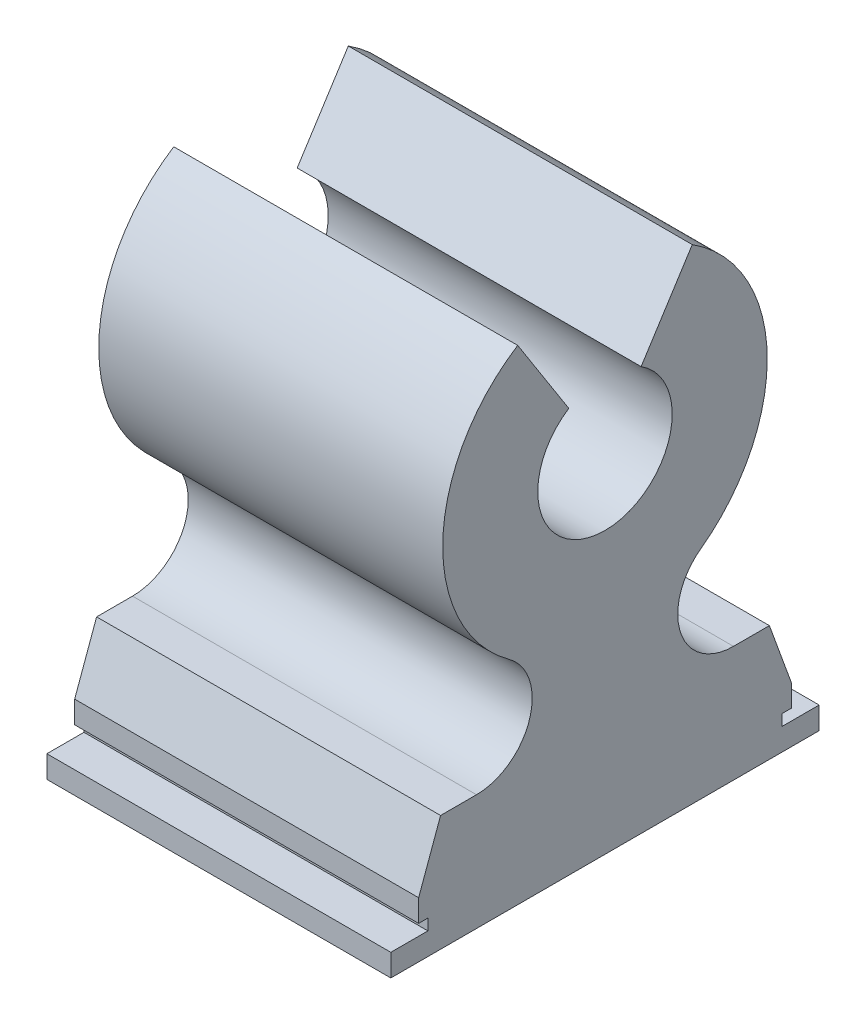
ISO-10303-21;
HEADER;
FILE_DESCRIPTION(('STEP AP214'),'2;1');
FILE_NAME('part.step','',(''),(''),'','','');
FILE_SCHEMA(('AUTOMOTIVE_DESIGN { 1 0 10303 214 1 1 1 1 }'));
ENDSEC;
DATA;
#1=APPLICATION_CONTEXT('core data for automotive mechanical design processes');
#2=APPLICATION_PROTOCOL_DEFINITION('international standard','automotive_design',2000,#1);
#3=PRODUCT_CONTEXT('',#1,'mechanical');
#4=PRODUCT('Part','Part','',(#3));
#5=PRODUCT_RELATED_PRODUCT_CATEGORY('part','',(#4));
#6=PRODUCT_DEFINITION_FORMATION('','',#4);
#7=PRODUCT_DEFINITION_CONTEXT('part definition',#1,'design');
#8=PRODUCT_DEFINITION('design','',#6,#7);
#9=PRODUCT_DEFINITION_SHAPE('','',#8);
#10=(LENGTH_UNIT() NAMED_UNIT(*) SI_UNIT(.MILLI.,.METRE.));
#11=(NAMED_UNIT(*) PLANE_ANGLE_UNIT() SI_UNIT($,.RADIAN.));
#12=(NAMED_UNIT(*) SI_UNIT($,.STERADIAN.) SOLID_ANGLE_UNIT());
#13=UNCERTAINTY_MEASURE_WITH_UNIT(LENGTH_MEASURE(1.E-05),#10,'distance_accuracy_value','');
#14=(GEOMETRIC_REPRESENTATION_CONTEXT(3) GLOBAL_UNCERTAINTY_ASSIGNED_CONTEXT((#13)) GLOBAL_UNIT_ASSIGNED_CONTEXT((#10,
#11,#12)) REPRESENTATION_CONTEXT('',''));
#15=CARTESIAN_POINT('',(0.,0.,0.));
#16=DIRECTION('',(0.,0.,1.));
#17=DIRECTION('',(1.,0.,0.));
#18=AXIS2_PLACEMENT_3D('',#15,#16,#17);
#19=CARTESIAN_POINT('',(9.4234,-9.525,5.8674));
#20=DIRECTION('',(0.,0.,-1.));
#21=DIRECTION('',(0.,1.,0.));
#22=AXIS2_PLACEMENT_3D('',#19,#20,#21);
#23=PLANE('',#22);
#24=DIRECTION('',(0.,-1.,0.));
#25=VECTOR('',#24,1.);
#26=CARTESIAN_POINT('',(0.,-9.525,5.8674));
#27=LINE('',#26,#25);
#28=CARTESIAN_POINT('',(0.,-8.9154,5.8674));
#29=VERTEX_POINT('',#28);
#30=CARTESIAN_POINT('',(0.,-9.525,5.8674));
#31=VERTEX_POINT('',#30);
#32=EDGE_CURVE('E213',#29,#31,#27,.T.);
#33=ORIENTED_EDGE('',*,*,#32,.T.);
#34=DIRECTION('',(-1.,0.,0.));
#35=VECTOR('',#34,1.);
#36=CARTESIAN_POINT('',(9.4234,-9.525,5.8674));
#37=LINE('',#36,#35);
#38=CARTESIAN_POINT('',(9.4234,-9.525,5.8674));
#39=VERTEX_POINT('',#38);
#40=EDGE_CURVE('E11',#39,#31,#37,.T.);
#41=ORIENTED_EDGE('',*,*,#40,.F.);
#42=DIRECTION('',(0.,-1.,0.));
#43=VECTOR('',#42,1.);
#44=CARTESIAN_POINT('',(9.4234,-9.525,5.8674));
#45=LINE('',#44,#43);
#46=CARTESIAN_POINT('',(9.4234,-8.9154,5.8674));
#47=VERTEX_POINT('',#46);
#48=EDGE_CURVE('E255',#47,#39,#45,.T.);
#49=ORIENTED_EDGE('',*,*,#48,.F.);
#50=DIRECTION('',(-1.,0.,0.));
#51=VECTOR('',#50,1.);
#52=CARTESIAN_POINT('',(9.4234,-8.9154,5.8674));
#53=LINE('',#52,#51);
#54=EDGE_CURVE('E209',#47,#29,#53,.T.);
#55=ORIENTED_EDGE('',*,*,#54,.T.);
#56=EDGE_LOOP('',(#33,#41,#49,#55));
#57=FACE_BOUND('',#56,.T.);
#58=ADVANCED_FACE('F33',(#57),#23,.F.);
#59=CARTESIAN_POINT('',(9.4234,-9.525,5.8674));
#60=DIRECTION('',(0.,1.,0.));
#61=DIRECTION('',(0.,0.,1.));
#62=AXIS2_PLACEMENT_3D('',#59,#60,#61);
#63=PLANE('',#62);
#64=DIRECTION('',(0.,0.,-1.));
#65=VECTOR('',#64,1.);
#66=CARTESIAN_POINT('',(0.,-9.525,5.8674));
#67=LINE('',#66,#65);
#68=CARTESIAN_POINT('',(0.,-9.525,-5.8674));
#69=VERTEX_POINT('',#68);
#70=EDGE_CURVE('E216',#31,#69,#67,.T.);
#71=ORIENTED_EDGE('',*,*,#70,.T.);
#72=DIRECTION('',(-1.,0.,0.));
#73=VECTOR('',#72,1.);
#74=CARTESIAN_POINT('',(9.4234,-9.525,-5.8674));
#75=LINE('',#74,#73);
#76=CARTESIAN_POINT('',(9.4234,-9.525,-5.8674));
#77=VERTEX_POINT('',#76);
#78=EDGE_CURVE('E41',#77,#69,#75,.T.);
#79=ORIENTED_EDGE('',*,*,#78,.F.);
#80=DIRECTION('',(0.,0.,-1.));
#81=VECTOR('',#80,1.);
#82=CARTESIAN_POINT('',(9.4234,-9.525,5.8674));
#83=LINE('',#82,#81);
#84=EDGE_CURVE('E134',#39,#77,#83,.T.);
#85=ORIENTED_EDGE('',*,*,#84,.F.);
#86=ORIENTED_EDGE('',*,*,#40,.T.);
#87=EDGE_LOOP('',(#71,#79,#85,#86));
#88=FACE_BOUND('',#87,.T.);
#89=ADVANCED_FACE('F383',(#88),#63,.F.);
#90=CARTESIAN_POINT('',(9.4234,-9.525,-5.8674));
#91=DIRECTION('',(0.,0.,1.));
#92=DIRECTION('',(0.,-1.,0.));
#93=AXIS2_PLACEMENT_3D('',#90,#91,#92);
#94=PLANE('',#93);
#95=DIRECTION('',(0.,1.,0.));
#96=VECTOR('',#95,1.);
#97=CARTESIAN_POINT('',(0.,-9.525,-5.8674));
#98=LINE('',#97,#96);
#99=CARTESIAN_POINT('',(0.,-8.9154,-5.8674));
#100=VERTEX_POINT('',#99);
#101=EDGE_CURVE('E218',#69,#100,#98,.T.);
#102=ORIENTED_EDGE('',*,*,#101,.T.);
#103=DIRECTION('',(-1.,0.,0.));
#104=VECTOR('',#103,1.);
#105=CARTESIAN_POINT('',(9.4234,-8.9154,-5.8674));
#106=LINE('',#105,#104);
#107=CARTESIAN_POINT('',(9.4234,-8.9154,-5.8674));
#108=VERTEX_POINT('',#107);
#109=EDGE_CURVE('E304',#108,#100,#106,.T.);
#110=ORIENTED_EDGE('',*,*,#109,.F.);
#111=DIRECTION('',(0.,1.,0.));
#112=VECTOR('',#111,1.);
#113=CARTESIAN_POINT('',(9.4234,-9.525,-5.8674));
#114=LINE('',#113,#112);
#115=EDGE_CURVE('E312',#77,#108,#114,.T.);
#116=ORIENTED_EDGE('',*,*,#115,.F.);
#117=ORIENTED_EDGE('',*,*,#78,.T.);
#118=EDGE_LOOP('',(#102,#110,#116,#117));
#119=FACE_BOUND('',#118,.T.);
#120=ADVANCED_FACE('F310',(#119),#94,.F.);
#121=CARTESIAN_POINT('',(9.4234,-8.9154,-5.8674));
#122=DIRECTION('',(0.,-1.,0.));
#123=DIRECTION('',(0.,0.,-1.));
#124=AXIS2_PLACEMENT_3D('',#121,#122,#123);
#125=PLANE('',#124);
#126=DIRECTION('',(0.,0.,1.));
#127=VECTOR('',#126,1.);
#128=CARTESIAN_POINT('',(0.,-8.9154,-5.8674));
#129=LINE('',#128,#127);
#130=CARTESIAN_POINT('',(0.,-8.9154,-4.8514));
#131=VERTEX_POINT('',#130);
#132=EDGE_CURVE('E220',#100,#131,#129,.T.);
#133=ORIENTED_EDGE('',*,*,#132,.T.);
#134=DIRECTION('',(-1.,0.,0.));
#135=VECTOR('',#134,1.);
#136=CARTESIAN_POINT('',(9.4234,-8.9154,-4.8514));
#137=LINE('',#136,#135);
#138=CARTESIAN_POINT('',(9.4234,-8.9154,-4.8514));
#139=VERTEX_POINT('',#138);
#140=EDGE_CURVE('E301',#139,#131,#137,.T.);
#141=ORIENTED_EDGE('',*,*,#140,.F.);
#142=DIRECTION('',(0.,0.,1.));
#143=VECTOR('',#142,1.);
#144=CARTESIAN_POINT('',(9.4234,-8.9154,-5.8674));
#145=LINE('',#144,#143);
#146=EDGE_CURVE('E330',#108,#139,#145,.T.);
#147=ORIENTED_EDGE('',*,*,#146,.F.);
#148=ORIENTED_EDGE('',*,*,#109,.T.);
#149=EDGE_LOOP('',(#133,#141,#147,#148));
#150=FACE_BOUND('',#149,.T.);
#151=ADVANCED_FACE('F321',(#150),#125,.F.);
#152=CARTESIAN_POINT('',(9.4234,-8.9154,-4.8514));
#153=DIRECTION('',(0.,0.,1.));
#154=DIRECTION('',(0.,-1.,0.));
#155=AXIS2_PLACEMENT_3D('',#152,#153,#154);
#156=PLANE('',#155);
#157=DIRECTION('',(0.,1.,0.));
#158=VECTOR('',#157,1.);
#159=CARTESIAN_POINT('',(0.,-8.9154,-4.8514));
#160=LINE('',#159,#158);
#161=CARTESIAN_POINT('',(0.,-8.6106,-4.8514));
#162=VERTEX_POINT('',#161);
#163=EDGE_CURVE('E222',#131,#162,#160,.T.);
#164=ORIENTED_EDGE('',*,*,#163,.T.);
#165=DIRECTION('',(-1.,0.,0.));
#166=VECTOR('',#165,1.);
#167=CARTESIAN_POINT('',(9.4234,-8.6106,-4.8514));
#168=LINE('',#167,#166);
#169=CARTESIAN_POINT('',(9.4234,-8.6106,-4.8514));
#170=VERTEX_POINT('',#169);
#171=EDGE_CURVE('E298',#170,#162,#168,.T.);
#172=ORIENTED_EDGE('',*,*,#171,.F.);
#173=DIRECTION('',(0.,1.,0.));
#174=VECTOR('',#173,1.);
#175=CARTESIAN_POINT('',(9.4234,-8.9154,-4.8514));
#176=LINE('',#175,#174);
#177=EDGE_CURVE('E327',#139,#170,#176,.T.);
#178=ORIENTED_EDGE('',*,*,#177,.F.);
#179=ORIENTED_EDGE('',*,*,#140,.T.);
#180=EDGE_LOOP('',(#164,#172,#178,#179));
#181=FACE_BOUND('',#180,.T.);
#182=ADVANCED_FACE('F325',(#181),#156,.F.);
#183=CARTESIAN_POINT('',(9.4234,-8.6106,-4.8514));
#184=DIRECTION('',(0.,1.,0.));
#185=DIRECTION('',(0.,0.,1.));
#186=AXIS2_PLACEMENT_3D('',#183,#184,#185);
#187=PLANE('',#186);
#188=DIRECTION('',(0.,0.,-1.));
#189=VECTOR('',#188,1.);
#190=CARTESIAN_POINT('',(0.,-8.6106,-4.8514));
#191=LINE('',#190,#189);
#192=CARTESIAN_POINT('',(0.,-8.6106,-5.1054));
#193=VERTEX_POINT('',#192);
#194=EDGE_CURVE('E224',#162,#193,#191,.T.);
#195=ORIENTED_EDGE('',*,*,#194,.T.);
#196=DIRECTION('',(-1.,0.,0.));
#197=VECTOR('',#196,1.);
#198=CARTESIAN_POINT('',(9.4234,-8.6106,-5.1054));
#199=LINE('',#198,#197);
#200=CARTESIAN_POINT('',(9.4234,-8.6106,-5.1054));
#201=VERTEX_POINT('',#200);
#202=EDGE_CURVE('E295',#201,#193,#199,.T.);
#203=ORIENTED_EDGE('',*,*,#202,.F.);
#204=DIRECTION('',(0.,0.,-1.));
#205=VECTOR('',#204,1.);
#206=CARTESIAN_POINT('',(9.4234,-8.6106,-4.8514));
#207=LINE('',#206,#205);
#208=EDGE_CURVE('E329',#170,#201,#207,.T.);
#209=ORIENTED_EDGE('',*,*,#208,.F.);
#210=ORIENTED_EDGE('',*,*,#171,.T.);
#211=EDGE_LOOP('',(#195,#203,#209,#210));
#212=FACE_BOUND('',#211,.T.);
#213=ADVANCED_FACE('F396',(#212),#187,.F.);
#214=CARTESIAN_POINT('',(9.4234,-8.001,-5.1054));
#215=DIRECTION('',(0.,0.,1.));
#216=DIRECTION('',(0.,-1.,0.));
#217=AXIS2_PLACEMENT_3D('',#214,#215,#216);
#218=PLANE('',#217);
#219=DIRECTION('',(0.,1.,0.));
#220=VECTOR('',#219,1.);
#221=CARTESIAN_POINT('',(0.,-8.001,-5.1054));
#222=LINE('',#221,#220);
#223=CARTESIAN_POINT('',(0.,-8.001,-5.1054));
#224=VERTEX_POINT('',#223);
#225=EDGE_CURVE('E226',#193,#224,#222,.T.);
#226=ORIENTED_EDGE('',*,*,#225,.T.);
#227=DIRECTION('',(-1.,0.,0.));
#228=VECTOR('',#227,1.);
#229=CARTESIAN_POINT('',(9.4234,-8.001,-5.1054));
#230=LINE('',#229,#228);
#231=CARTESIAN_POINT('',(9.4234,-8.001,-5.1054));
#232=VERTEX_POINT('',#231);
#233=EDGE_CURVE('E292',#232,#224,#230,.T.);
#234=ORIENTED_EDGE('',*,*,#233,.F.);
#235=DIRECTION('',(0.,1.,0.));
#236=VECTOR('',#235,1.);
#237=CARTESIAN_POINT('',(9.4234,-8.001,-5.1054));
#238=LINE('',#237,#236);
#239=EDGE_CURVE('E332',#201,#232,#238,.T.);
#240=ORIENTED_EDGE('',*,*,#239,.F.);
#241=ORIENTED_EDGE('',*,*,#202,.T.);
#242=EDGE_LOOP('',(#226,#234,#240,#241));
#243=FACE_BOUND('',#242,.T.);
#244=ADVANCED_FACE('F399',(#243),#218,.F.);
#245=CARTESIAN_POINT('',(9.4234,-6.35,-4.5044851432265));
#246=DIRECTION('',(0.,-0.34202014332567,0.939692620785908));
#247=DIRECTION('',(0.,-0.939692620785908,-0.34202014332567));
#248=AXIS2_PLACEMENT_3D('',#245,#246,#247);
#249=PLANE('',#248);
#250=DIRECTION('',(0.,0.939692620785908,0.34202014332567));
#251=VECTOR('',#250,1.);
#252=CARTESIAN_POINT('',(0.,-6.35,-4.5044851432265));
#253=LINE('',#252,#251);
#254=CARTESIAN_POINT('',(0.,-6.35,-4.5044851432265));
#255=VERTEX_POINT('',#254);
#256=EDGE_CURVE('E228',#224,#255,#253,.T.);
#257=ORIENTED_EDGE('',*,*,#256,.T.);
#258=DIRECTION('',(-1.,0.,0.));
#259=VECTOR('',#258,1.);
#260=CARTESIAN_POINT('',(9.4234,-6.35,-4.5044851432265));
#261=LINE('',#260,#259);
#262=CARTESIAN_POINT('',(9.4234,-6.35,-4.5044851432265));
#263=VERTEX_POINT('',#262);
#264=EDGE_CURVE('E289',#263,#255,#261,.T.);
#265=ORIENTED_EDGE('',*,*,#264,.F.);
#266=DIRECTION('',(0.,0.939692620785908,0.34202014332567));
#267=VECTOR('',#266,1.);
#268=CARTESIAN_POINT('',(9.4234,-6.35,-4.5044851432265));
#269=LINE('',#268,#267);
#270=EDGE_CURVE('E338',#232,#263,#269,.T.);
#271=ORIENTED_EDGE('',*,*,#270,.F.);
#272=ORIENTED_EDGE('',*,*,#233,.T.);
#273=EDGE_LOOP('',(#257,#265,#271,#272));
#274=FACE_BOUND('',#273,.T.);
#275=ADVANCED_FACE('F403',(#274),#249,.F.);
#276=CARTESIAN_POINT('',(9.4234,-6.35,-4.5044851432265));
#277=DIRECTION('',(0.,-1.,0.));
#278=DIRECTION('',(0.,0.,-1.));
#279=AXIS2_PLACEMENT_3D('',#276,#277,#278);
#280=PLANE('',#279);
#281=DIRECTION('',(0.,0.,1.));
#282=VECTOR('',#281,1.);
#283=CARTESIAN_POINT('',(0.,-6.35,-4.5044851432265));
#284=LINE('',#283,#282);
#285=CARTESIAN_POINT('',(0.,-6.35,-3.5204382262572));
#286=VERTEX_POINT('',#285);
#287=EDGE_CURVE('E230',#255,#286,#284,.T.);
#288=ORIENTED_EDGE('',*,*,#287,.T.);
#289=DIRECTION('',(-1.,0.,0.));
#290=VECTOR('',#289,1.);
#291=CARTESIAN_POINT('',(9.4234,-6.35,-3.5204382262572));
#292=LINE('',#291,#290);
#293=CARTESIAN_POINT('',(9.4234,-6.35,-3.5204382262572));
#294=VERTEX_POINT('',#293);
#295=EDGE_CURVE('E286',#294,#286,#292,.T.);
#296=ORIENTED_EDGE('',*,*,#295,.F.);
#297=DIRECTION('',(0.,0.,1.));
#298=VECTOR('',#297,1.);
#299=CARTESIAN_POINT('',(9.4234,-6.35,-4.5044851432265));
#300=LINE('',#299,#298);
#301=EDGE_CURVE('E340',#263,#294,#300,.T.);
#302=ORIENTED_EDGE('',*,*,#301,.F.);
#303=ORIENTED_EDGE('',*,*,#264,.T.);
#304=EDGE_LOOP('',(#288,#296,#302,#303));
#305=FACE_BOUND('',#304,.T.);
#306=ADVANCED_FACE('F407',(#305),#280,.F.);
#307=CARTESIAN_POINT('',(9.4234,-4.8234617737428,-3.5204382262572));
#308=DIRECTION('',(-1.,0.,0.));
#309=DIRECTION('',(0.,0.,1.));
#310=AXIS2_PLACEMENT_3D('',#307,#308,#309);
#311=CYLINDRICAL_SURFACE('',#310,1.5265382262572);
#312=CARTESIAN_POINT('',(0.,-4.8234617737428,-3.5204382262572));
#313=DIRECTION('',(-1.,0.,0.));
#314=DIRECTION('',(0.,0.,1.));
#315=AXIS2_PLACEMENT_3D('',#312,#313,#314);
#316=CIRCLE('',#315,1.5265382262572);
#317=CARTESIAN_POINT('',(0.,-3.59041285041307,-2.62048861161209));
#318=VERTEX_POINT('',#317);
#319=EDGE_CURVE('E232',#286,#318,#316,.T.);
#320=ORIENTED_EDGE('',*,*,#319,.T.);
#321=DIRECTION('',(-1.,0.,0.));
#322=VECTOR('',#321,1.);
#323=CARTESIAN_POINT('',(9.4234,-3.59041285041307,-2.62048861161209));
#324=LINE('',#323,#322);
#325=CARTESIAN_POINT('',(9.4234,-3.59041285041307,-2.62048861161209));
#326=VERTEX_POINT('',#325);
#327=EDGE_CURVE('E283',#326,#318,#324,.T.);
#328=ORIENTED_EDGE('',*,*,#327,.F.);
#329=CARTESIAN_POINT('',(9.4234,-4.8234617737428,-3.5204382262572));
#330=DIRECTION('',(-1.,0.,0.));
#331=DIRECTION('',(0.,0.,1.));
#332=AXIS2_PLACEMENT_3D('',#329,#330,#331);
#333=CIRCLE('',#332,1.5265382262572);
#334=EDGE_CURVE('E342',#294,#326,#333,.T.);
#335=ORIENTED_EDGE('',*,*,#334,.F.);
#336=ORIENTED_EDGE('',*,*,#295,.T.);
#337=EDGE_LOOP('',(#320,#328,#335,#336));
#338=FACE_BOUND('',#337,.T.);
#339=ADVANCED_FACE('F411',(#338),#311,.F.);
#340=CARTESIAN_POINT('',(9.4234,0.,0.));
#341=DIRECTION('',(-1.,0.,0.));
#342=DIRECTION('',(0.,0.,1.));
#343=AXIS2_PLACEMENT_3D('',#340,#341,#342);
#344=CYLINDRICAL_SURFACE('',#343,4.445);
#345=CARTESIAN_POINT('',(0.,0.,0.));
#346=DIRECTION('',(1.,0.,0.));
#347=DIRECTION('',(0.,0.,-1.));
#348=AXIS2_PLACEMENT_3D('',#345,#346,#347);
#349=CIRCLE('',#348,4.445);
#350=CARTESIAN_POINT('',(0.,3.74708544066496,-2.39110344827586));
#351=VERTEX_POINT('',#350);
#352=EDGE_CURVE('E234',#318,#351,#349,.T.);
#353=ORIENTED_EDGE('',*,*,#352,.T.);
#354=DIRECTION('',(-1.,0.,0.));
#355=VECTOR('',#354,1.);
#356=CARTESIAN_POINT('',(9.4234,3.74708544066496,-2.39110344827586));
#357=LINE('',#356,#355);
#358=CARTESIAN_POINT('',(9.4234,3.74708544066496,-2.39110344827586));
#359=VERTEX_POINT('',#358);
#360=EDGE_CURVE('E280',#359,#351,#357,.T.);
#361=ORIENTED_EDGE('',*,*,#360,.F.);
#362=CARTESIAN_POINT('',(9.4234,0.,0.));
#363=DIRECTION('',(1.,0.,0.));
#364=DIRECTION('',(0.,0.,-1.));
#365=AXIS2_PLACEMENT_3D('',#362,#363,#364);
#366=CIRCLE('',#365,4.445);
#367=EDGE_CURVE('E344',#326,#359,#366,.T.);
#368=ORIENTED_EDGE('',*,*,#367,.F.);
#369=ORIENTED_EDGE('',*,*,#327,.T.);
#370=EDGE_LOOP('',(#353,#361,#368,#369));
#371=FACE_BOUND('',#370,.T.);
#372=ADVANCED_FACE('F415',(#371),#344,.T.);
#373=CARTESIAN_POINT('',(9.4234,1.55236396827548,-0.9906));
#374=DIRECTION('',(0.,-0.537931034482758,-0.842988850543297));
#375=DIRECTION('',(0.,0.842988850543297,-0.537931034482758));
#376=AXIS2_PLACEMENT_3D('',#373,#374,#375);
#377=PLANE('',#376);
#378=DIRECTION('',(0.,-0.842988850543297,0.537931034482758));
#379=VECTOR('',#378,1.);
#380=CARTESIAN_POINT('',(0.,1.55236396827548,-0.9906));
#381=LINE('',#380,#379);
#382=CARTESIAN_POINT('',(0.,1.55236396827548,-0.9906));
#383=VERTEX_POINT('',#382);
#384=EDGE_CURVE('E236',#351,#383,#381,.T.);
#385=ORIENTED_EDGE('',*,*,#384,.T.);
#386=DIRECTION('',(-1.,0.,0.));
#387=VECTOR('',#386,1.);
#388=CARTESIAN_POINT('',(9.4234,1.55236396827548,-0.9906));
#389=LINE('',#388,#387);
#390=CARTESIAN_POINT('',(9.4234,1.55236396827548,-0.9906));
#391=VERTEX_POINT('',#390);
#392=EDGE_CURVE('E277',#391,#383,#389,.T.);
#393=ORIENTED_EDGE('',*,*,#392,.F.);
#394=DIRECTION('',(0.,-0.842988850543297,0.537931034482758));
#395=VECTOR('',#394,1.);
#396=CARTESIAN_POINT('',(9.4234,1.55236396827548,-0.9906));
#397=LINE('',#396,#395);
#398=EDGE_CURVE('E346',#359,#391,#397,.T.);
#399=ORIENTED_EDGE('',*,*,#398,.F.);
#400=ORIENTED_EDGE('',*,*,#360,.T.);
#401=EDGE_LOOP('',(#385,#393,#399,#400));
#402=FACE_BOUND('',#401,.T.);
#403=ADVANCED_FACE('F419',(#402),#377,.F.);
#404=CARTESIAN_POINT('',(9.4234,0.,0.));
#405=DIRECTION('',(-1.,0.,0.));
#406=DIRECTION('',(0.,0.,1.));
#407=AXIS2_PLACEMENT_3D('',#404,#405,#406);
#408=CYLINDRICAL_SURFACE('',#407,1.8415);
#409=CARTESIAN_POINT('',(0.,0.,0.));
#410=DIRECTION('',(-1.,0.,0.));
#411=DIRECTION('',(0.,0.,-1.));
#412=AXIS2_PLACEMENT_3D('',#409,#410,#411);
#413=CIRCLE('',#412,1.8415);
#414=CARTESIAN_POINT('',(0.,1.55236396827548,0.990599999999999));
#415=VERTEX_POINT('',#414);
#416=EDGE_CURVE('E238',#383,#415,#413,.T.);
#417=ORIENTED_EDGE('',*,*,#416,.T.);
#418=DIRECTION('',(-1.,0.,0.));
#419=VECTOR('',#418,1.);
#420=CARTESIAN_POINT('',(9.4234,1.55236396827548,0.990599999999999));
#421=LINE('',#420,#419);
#422=CARTESIAN_POINT('',(9.4234,1.55236396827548,0.990599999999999));
#423=VERTEX_POINT('',#422);
#424=EDGE_CURVE('E274',#423,#415,#421,.T.);
#425=ORIENTED_EDGE('',*,*,#424,.F.);
#426=CARTESIAN_POINT('',(9.4234,0.,0.));
#427=DIRECTION('',(-1.,0.,0.));
#428=DIRECTION('',(0.,0.,-1.));
#429=AXIS2_PLACEMENT_3D('',#426,#427,#428);
#430=CIRCLE('',#429,1.8415);
#431=EDGE_CURVE('E348',#391,#423,#430,.T.);
#432=ORIENTED_EDGE('',*,*,#431,.F.);
#433=ORIENTED_EDGE('',*,*,#392,.T.);
#434=EDGE_LOOP('',(#417,#425,#432,#433));
#435=FACE_BOUND('',#434,.T.);
#436=ADVANCED_FACE('F423',(#435),#408,.F.);
#437=CARTESIAN_POINT('',(9.4234,1.55236396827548,0.9906));
#438=DIRECTION('',(0.,-0.537931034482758,0.842988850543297));
#439=DIRECTION('',(0.,-0.842988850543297,-0.537931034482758));
#440=AXIS2_PLACEMENT_3D('',#437,#438,#439);
#441=PLANE('',#440);
#442=DIRECTION('',(0.,0.842988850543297,0.537931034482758));
#443=VECTOR('',#442,1.);
#444=CARTESIAN_POINT('',(0.,1.55236396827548,0.9906));
#445=LINE('',#444,#443);
#446=CARTESIAN_POINT('',(0.,3.74708544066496,2.39110344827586));
#447=VERTEX_POINT('',#446);
#448=EDGE_CURVE('E240',#415,#447,#445,.T.);
#449=ORIENTED_EDGE('',*,*,#448,.T.);
#450=DIRECTION('',(-1.,0.,0.));
#451=VECTOR('',#450,1.);
#452=CARTESIAN_POINT('',(9.4234,3.74708544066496,2.39110344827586));
#453=LINE('',#452,#451);
#454=CARTESIAN_POINT('',(9.4234,3.74708544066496,2.39110344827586));
#455=VERTEX_POINT('',#454);
#456=EDGE_CURVE('E271',#455,#447,#453,.T.);
#457=ORIENTED_EDGE('',*,*,#456,.F.);
#458=DIRECTION('',(0.,0.842988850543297,0.537931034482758));
#459=VECTOR('',#458,1.);
#460=CARTESIAN_POINT('',(9.4234,1.55236396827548,0.9906));
#461=LINE('',#460,#459);
#462=EDGE_CURVE('E350',#423,#455,#461,.T.);
#463=ORIENTED_EDGE('',*,*,#462,.F.);
#464=ORIENTED_EDGE('',*,*,#424,.T.);
#465=EDGE_LOOP('',(#449,#457,#463,#464));
#466=FACE_BOUND('',#465,.T.);
#467=ADVANCED_FACE('F427',(#466),#441,.F.);
#468=CARTESIAN_POINT('',(9.4234,0.,0.));
#469=DIRECTION('',(-1.,0.,0.));
#470=DIRECTION('',(0.,0.,1.));
#471=AXIS2_PLACEMENT_3D('',#468,#469,#470);
#472=CYLINDRICAL_SURFACE('',#471,4.445);
#473=CARTESIAN_POINT('',(0.,0.,0.));
#474=DIRECTION('',(1.,0.,0.));
#475=DIRECTION('',(0.,0.,-1.));
#476=AXIS2_PLACEMENT_3D('',#473,#474,#475);
#477=CIRCLE('',#476,4.445);
#478=CARTESIAN_POINT('',(0.,-3.59041285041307,2.62048861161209));
#479=VERTEX_POINT('',#478);
#480=EDGE_CURVE('E242',#447,#479,#477,.T.);
#481=ORIENTED_EDGE('',*,*,#480,.T.);
#482=DIRECTION('',(-1.,0.,0.));
#483=VECTOR('',#482,1.);
#484=CARTESIAN_POINT('',(9.4234,-3.59041285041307,2.62048861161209));
#485=LINE('',#484,#483);
#486=CARTESIAN_POINT('',(9.4234,-3.59041285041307,2.62048861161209));
#487=VERTEX_POINT('',#486);
#488=EDGE_CURVE('E268',#487,#479,#485,.T.);
#489=ORIENTED_EDGE('',*,*,#488,.F.);
#490=CARTESIAN_POINT('',(9.4234,0.,0.));
#491=DIRECTION('',(1.,0.,0.));
#492=DIRECTION('',(0.,0.,-1.));
#493=AXIS2_PLACEMENT_3D('',#490,#491,#492);
#494=CIRCLE('',#493,4.445);
#495=EDGE_CURVE('E352',#455,#487,#494,.T.);
#496=ORIENTED_EDGE('',*,*,#495,.F.);
#497=ORIENTED_EDGE('',*,*,#456,.T.);
#498=EDGE_LOOP('',(#481,#489,#496,#497));
#499=FACE_BOUND('',#498,.T.);
#500=ADVANCED_FACE('F431',(#499),#472,.T.);
#501=CARTESIAN_POINT('',(9.4234,-4.8234617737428,3.5204382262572));
#502=DIRECTION('',(-1.,0.,0.));
#503=DIRECTION('',(0.,0.,1.));
#504=AXIS2_PLACEMENT_3D('',#501,#502,#503);
#505=CYLINDRICAL_SURFACE('',#504,1.5265382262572);
#506=CARTESIAN_POINT('',(0.,-4.8234617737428,3.5204382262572));
#507=DIRECTION('',(-1.,0.,0.));
#508=DIRECTION('',(0.,0.,1.));
#509=AXIS2_PLACEMENT_3D('',#506,#507,#508);
#510=CIRCLE('',#509,1.5265382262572);
#511=CARTESIAN_POINT('',(0.,-6.35,3.5204382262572));
#512=VERTEX_POINT('',#511);
#513=EDGE_CURVE('E244',#479,#512,#510,.T.);
#514=ORIENTED_EDGE('',*,*,#513,.T.);
#515=DIRECTION('',(-1.,0.,0.));
#516=VECTOR('',#515,1.);
#517=CARTESIAN_POINT('',(9.4234,-6.35,3.5204382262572));
#518=LINE('',#517,#516);
#519=CARTESIAN_POINT('',(9.4234,-6.35,3.5204382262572));
#520=VERTEX_POINT('',#519);
#521=EDGE_CURVE('E265',#520,#512,#518,.T.);
#522=ORIENTED_EDGE('',*,*,#521,.F.);
#523=CARTESIAN_POINT('',(9.4234,-4.8234617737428,3.5204382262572));
#524=DIRECTION('',(-1.,0.,0.));
#525=DIRECTION('',(0.,0.,1.));
#526=AXIS2_PLACEMENT_3D('',#523,#524,#525);
#527=CIRCLE('',#526,1.5265382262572);
#528=EDGE_CURVE('E354',#487,#520,#527,.T.);
#529=ORIENTED_EDGE('',*,*,#528,.F.);
#530=ORIENTED_EDGE('',*,*,#488,.T.);
#531=EDGE_LOOP('',(#514,#522,#529,#530));
#532=FACE_BOUND('',#531,.T.);
#533=ADVANCED_FACE('F435',(#532),#505,.F.);
#534=CARTESIAN_POINT('',(9.4234,-6.35,3.5204382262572));
#535=DIRECTION('',(0.,-1.,0.));
#536=DIRECTION('',(0.,0.,-1.));
#537=AXIS2_PLACEMENT_3D('',#534,#535,#536);
#538=PLANE('',#537);
#539=DIRECTION('',(0.,0.,1.));
#540=VECTOR('',#539,1.);
#541=CARTESIAN_POINT('',(0.,-6.35,3.5204382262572));
#542=LINE('',#541,#540);
#543=CARTESIAN_POINT('',(0.,-6.35,4.5044851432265));
#544=VERTEX_POINT('',#543);
#545=EDGE_CURVE('E246',#512,#544,#542,.T.);
#546=ORIENTED_EDGE('',*,*,#545,.T.);
#547=DIRECTION('',(-1.,0.,0.));
#548=VECTOR('',#547,1.);
#549=CARTESIAN_POINT('',(9.4234,-6.35,4.5044851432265));
#550=LINE('',#549,#548);
#551=CARTESIAN_POINT('',(9.4234,-6.35,4.5044851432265));
#552=VERTEX_POINT('',#551);
#553=EDGE_CURVE('E262',#552,#544,#550,.T.);
#554=ORIENTED_EDGE('',*,*,#553,.F.);
#555=DIRECTION('',(0.,0.,1.));
#556=VECTOR('',#555,1.);
#557=CARTESIAN_POINT('',(9.4234,-6.35,3.5204382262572));
#558=LINE('',#557,#556);
#559=EDGE_CURVE('E356',#520,#552,#558,.T.);
#560=ORIENTED_EDGE('',*,*,#559,.F.);
#561=ORIENTED_EDGE('',*,*,#521,.T.);
#562=EDGE_LOOP('',(#546,#554,#560,#561));
#563=FACE_BOUND('',#562,.T.);
#564=ADVANCED_FACE('F439',(#563),#538,.F.);
#565=CARTESIAN_POINT('',(9.4234,-6.35,4.5044851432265));
#566=DIRECTION('',(0.,-0.34202014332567,-0.939692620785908));
#567=DIRECTION('',(0.,0.939692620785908,-0.34202014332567));
#568=AXIS2_PLACEMENT_3D('',#565,#566,#567);
#569=PLANE('',#568);
#570=DIRECTION('',(0.,-0.939692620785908,0.34202014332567));
#571=VECTOR('',#570,1.);
#572=CARTESIAN_POINT('',(0.,-6.35,4.5044851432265));
#573=LINE('',#572,#571);
#574=CARTESIAN_POINT('',(0.,-8.001,5.1054));
#575=VERTEX_POINT('',#574);
#576=EDGE_CURVE('E248',#544,#575,#573,.T.);
#577=ORIENTED_EDGE('',*,*,#576,.T.);
#578=DIRECTION('',(-1.,0.,0.));
#579=VECTOR('',#578,1.);
#580=CARTESIAN_POINT('',(9.4234,-8.001,5.1054));
#581=LINE('',#580,#579);
#582=CARTESIAN_POINT('',(9.4234,-8.001,5.1054));
#583=VERTEX_POINT('',#582);
#584=EDGE_CURVE('E259',#583,#575,#581,.T.);
#585=ORIENTED_EDGE('',*,*,#584,.F.);
#586=DIRECTION('',(0.,-0.939692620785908,0.34202014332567));
#587=VECTOR('',#586,1.);
#588=CARTESIAN_POINT('',(9.4234,-6.35,4.5044851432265));
#589=LINE('',#588,#587);
#590=EDGE_CURVE('E358',#552,#583,#589,.T.);
#591=ORIENTED_EDGE('',*,*,#590,.F.);
#592=ORIENTED_EDGE('',*,*,#553,.T.);
#593=EDGE_LOOP('',(#577,#585,#591,#592));
#594=FACE_BOUND('',#593,.T.);
#595=ADVANCED_FACE('F364',(#594),#569,.F.);
#596=CARTESIAN_POINT('',(9.4234,-8.001,5.1054));
#597=DIRECTION('',(0.,0.,-1.));
#598=DIRECTION('',(0.,1.,0.));
#599=AXIS2_PLACEMENT_3D('',#596,#597,#598);
#600=PLANE('',#599);
#601=DIRECTION('',(0.,-1.,0.));
#602=VECTOR('',#601,1.);
#603=CARTESIAN_POINT('',(0.,-8.001,5.1054));
#604=LINE('',#603,#602);
#605=CARTESIAN_POINT('',(0.,-8.6106,5.1054));
#606=VERTEX_POINT('',#605);
#607=EDGE_CURVE('E250',#575,#606,#604,.T.);
#608=ORIENTED_EDGE('',*,*,#607,.T.);
#609=DIRECTION('',(-1.,0.,0.));
#610=VECTOR('',#609,1.);
#611=CARTESIAN_POINT('',(9.4234,-8.6106,5.1054));
#612=LINE('',#611,#610);
#613=CARTESIAN_POINT('',(9.4234,-8.6106,5.1054));
#614=VERTEX_POINT('',#613);
#615=EDGE_CURVE('E204',#614,#606,#612,.T.);
#616=ORIENTED_EDGE('',*,*,#615,.F.);
#617=DIRECTION('',(0.,-1.,0.));
#618=VECTOR('',#617,1.);
#619=CARTESIAN_POINT('',(9.4234,-8.001,5.1054));
#620=LINE('',#619,#618);
#621=EDGE_CURVE('E195',#583,#614,#620,.T.);
#622=ORIENTED_EDGE('',*,*,#621,.F.);
#623=ORIENTED_EDGE('',*,*,#584,.T.);
#624=EDGE_LOOP('',(#608,#616,#622,#623));
#625=FACE_BOUND('',#624,.T.);
#626=ADVANCED_FACE('F368',(#625),#600,.F.);
#627=CARTESIAN_POINT('',(9.4234,-8.6106,4.8514));
#628=DIRECTION('',(0.,1.,0.));
#629=DIRECTION('',(0.,0.,1.));
#630=AXIS2_PLACEMENT_3D('',#627,#628,#629);
#631=PLANE('',#630);
#632=DIRECTION('',(0.,0.,-1.));
#633=VECTOR('',#632,1.);
#634=CARTESIAN_POINT('',(0.,-8.6106,4.8514));
#635=LINE('',#634,#633);
#636=CARTESIAN_POINT('',(0.,-8.6106,4.8514));
#637=VERTEX_POINT('',#636);
#638=EDGE_CURVE('E203',#606,#637,#635,.T.);
#639=ORIENTED_EDGE('',*,*,#638,.T.);
#640=DIRECTION('',(-1.,0.,0.));
#641=VECTOR('',#640,1.);
#642=CARTESIAN_POINT('',(9.4234,-8.6106,4.8514));
#643=LINE('',#642,#641);
#644=CARTESIAN_POINT('',(9.4234,-8.6106,4.8514));
#645=VERTEX_POINT('',#644);
#646=EDGE_CURVE('E200',#645,#637,#643,.T.);
#647=ORIENTED_EDGE('',*,*,#646,.F.);
#648=DIRECTION('',(0.,0.,-1.));
#649=VECTOR('',#648,1.);
#650=CARTESIAN_POINT('',(9.4234,-8.6106,4.8514));
#651=LINE('',#650,#649);
#652=EDGE_CURVE('E189',#614,#645,#651,.T.);
#653=ORIENTED_EDGE('',*,*,#652,.F.);
#654=ORIENTED_EDGE('',*,*,#615,.T.);
#655=EDGE_LOOP('',(#639,#647,#653,#654));
#656=FACE_BOUND('',#655,.T.);
#657=ADVANCED_FACE('F201',(#656),#631,.F.);
#658=CARTESIAN_POINT('',(9.4234,-8.9154,4.8514));
#659=DIRECTION('',(0.,0.,-1.));
#660=DIRECTION('',(0.,1.,0.));
#661=AXIS2_PLACEMENT_3D('',#658,#659,#660);
#662=PLANE('',#661);
#663=DIRECTION('',(0.,-1.,0.));
#664=VECTOR('',#663,1.);
#665=CARTESIAN_POINT('',(0.,-8.9154,4.8514));
#666=LINE('',#665,#664);
#667=CARTESIAN_POINT('',(0.,-8.9154,4.8514));
#668=VERTEX_POINT('',#667);
#669=EDGE_CURVE('E120',#637,#668,#666,.T.);
#670=ORIENTED_EDGE('',*,*,#669,.T.);
#671=DIRECTION('',(-1.,0.,0.));
#672=VECTOR('',#671,1.);
#673=CARTESIAN_POINT('',(9.4234,-8.9154,4.8514));
#674=LINE('',#673,#672);
#675=CARTESIAN_POINT('',(9.4234,-8.9154,4.8514));
#676=VERTEX_POINT('',#675);
#677=EDGE_CURVE('E205',#676,#668,#674,.T.);
#678=ORIENTED_EDGE('',*,*,#677,.F.);
#679=DIRECTION('',(0.,-1.,0.));
#680=VECTOR('',#679,1.);
#681=CARTESIAN_POINT('',(9.4234,-8.9154,4.8514));
#682=LINE('',#681,#680);
#683=EDGE_CURVE('E193',#645,#676,#682,.T.);
#684=ORIENTED_EDGE('',*,*,#683,.F.);
#685=ORIENTED_EDGE('',*,*,#646,.T.);
#686=EDGE_LOOP('',(#670,#678,#684,#685));
#687=FACE_BOUND('',#686,.T.);
#688=ADVANCED_FACE('F207',(#687),#662,.F.);
#689=CARTESIAN_POINT('',(9.4234,-8.9154,5.8674));
#690=DIRECTION('',(0.,-1.,0.));
#691=DIRECTION('',(0.,0.,-1.));
#692=AXIS2_PLACEMENT_3D('',#689,#690,#691);
#693=PLANE('',#692);
#694=DIRECTION('',(0.,0.,1.));
#695=VECTOR('',#694,1.);
#696=CARTESIAN_POINT('',(0.,-8.9154,5.8674));
#697=LINE('',#696,#695);
#698=EDGE_CURVE('E126',#668,#29,#697,.T.);
#699=ORIENTED_EDGE('',*,*,#698,.T.);
#700=ORIENTED_EDGE('',*,*,#54,.F.);
#701=DIRECTION('',(0.,0.,1.));
#702=VECTOR('',#701,1.);
#703=CARTESIAN_POINT('',(9.4234,-8.9154,5.8674));
#704=LINE('',#703,#702);
#705=EDGE_CURVE('E49',#676,#47,#704,.T.);
#706=ORIENTED_EDGE('',*,*,#705,.F.);
#707=ORIENTED_EDGE('',*,*,#677,.T.);
#708=EDGE_LOOP('',(#699,#700,#706,#707));
#709=FACE_BOUND('',#708,.T.);
#710=ADVANCED_FACE('F372',(#709),#693,.F.);
#711=CARTESIAN_POINT('',(9.4234,-4.8234617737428,3.5204382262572));
#712=DIRECTION('',(-1.,0.,0.));
#713=DIRECTION('',(0.,0.,1.));
#714=AXIS2_PLACEMENT_3D('',#711,#712,#713);
#715=PLANE('',#714);
#716=ORIENTED_EDGE('',*,*,#48,.T.);
#717=ORIENTED_EDGE('',*,*,#84,.T.);
#718=ORIENTED_EDGE('',*,*,#115,.T.);
#719=ORIENTED_EDGE('',*,*,#146,.T.);
#720=ORIENTED_EDGE('',*,*,#177,.T.);
#721=ORIENTED_EDGE('',*,*,#208,.T.);
#722=ORIENTED_EDGE('',*,*,#239,.T.);
#723=ORIENTED_EDGE('',*,*,#270,.T.);
#724=ORIENTED_EDGE('',*,*,#301,.T.);
#725=ORIENTED_EDGE('',*,*,#334,.T.);
#726=ORIENTED_EDGE('',*,*,#367,.T.);
#727=ORIENTED_EDGE('',*,*,#398,.T.);
#728=ORIENTED_EDGE('',*,*,#431,.T.);
#729=ORIENTED_EDGE('',*,*,#462,.T.);
#730=ORIENTED_EDGE('',*,*,#495,.T.);
#731=ORIENTED_EDGE('',*,*,#528,.T.);
#732=ORIENTED_EDGE('',*,*,#559,.T.);
#733=ORIENTED_EDGE('',*,*,#590,.T.);
#734=ORIENTED_EDGE('',*,*,#621,.T.);
#735=ORIENTED_EDGE('',*,*,#652,.T.);
#736=ORIENTED_EDGE('',*,*,#683,.T.);
#737=ORIENTED_EDGE('',*,*,#705,.T.);
#738=EDGE_LOOP('',(#716,#717,#718,#719,#720,#721,#722,#723,#724,#725,#726,#727,#728,#729,#730,
#731,#732,#733,#734,#735,#736,#737));
#739=FACE_BOUND('',#738,.T.);
#740=ADVANCED_FACE('F191',(#739),#715,.F.);
#741=CARTESIAN_POINT('',(0.,-4.8234617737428,3.5204382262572));
#742=DIRECTION('',(-1.,0.,0.));
#743=DIRECTION('',(0.,0.,1.));
#744=AXIS2_PLACEMENT_3D('',#741,#742,#743);
#745=PLANE('',#744);
#746=ORIENTED_EDGE('',*,*,#32,.F.);
#747=ORIENTED_EDGE('',*,*,#698,.F.);
#748=ORIENTED_EDGE('',*,*,#669,.F.);
#749=ORIENTED_EDGE('',*,*,#638,.F.);
#750=ORIENTED_EDGE('',*,*,#607,.F.);
#751=ORIENTED_EDGE('',*,*,#576,.F.);
#752=ORIENTED_EDGE('',*,*,#545,.F.);
#753=ORIENTED_EDGE('',*,*,#513,.F.);
#754=ORIENTED_EDGE('',*,*,#480,.F.);
#755=ORIENTED_EDGE('',*,*,#448,.F.);
#756=ORIENTED_EDGE('',*,*,#416,.F.);
#757=ORIENTED_EDGE('',*,*,#384,.F.);
#758=ORIENTED_EDGE('',*,*,#352,.F.);
#759=ORIENTED_EDGE('',*,*,#319,.F.);
#760=ORIENTED_EDGE('',*,*,#287,.F.);
#761=ORIENTED_EDGE('',*,*,#256,.F.);
#762=ORIENTED_EDGE('',*,*,#225,.F.);
#763=ORIENTED_EDGE('',*,*,#194,.F.);
#764=ORIENTED_EDGE('',*,*,#163,.F.);
#765=ORIENTED_EDGE('',*,*,#132,.F.);
#766=ORIENTED_EDGE('',*,*,#101,.F.);
#767=ORIENTED_EDGE('',*,*,#70,.F.);
#768=EDGE_LOOP('',(#746,#747,#748,#749,#750,#751,#752,#753,#754,#755,#756,#757,#758,#759,#760,
#761,#762,#763,#764,#765,#766,#767));
#769=FACE_BOUND('',#768,.T.);
#770=ADVANCED_FACE('F316',(#769),#745,.T.);
#771=CLOSED_SHELL('',(#58,#89,#120,#151,#182,#213,#244,#275,#306,#339,#372,#403,#436,#467,#500,
#533,#564,#595,#626,#657,#688,#710,#740,#770));
#772=MANIFOLD_SOLID_BREP('B2',#771);
#773=ADVANCED_BREP_SHAPE_REPRESENTATION('',(#18,#772),#14);
#774=SHAPE_DEFINITION_REPRESENTATION(#9,#773);
ENDSEC;
END-ISO-10303-21;
